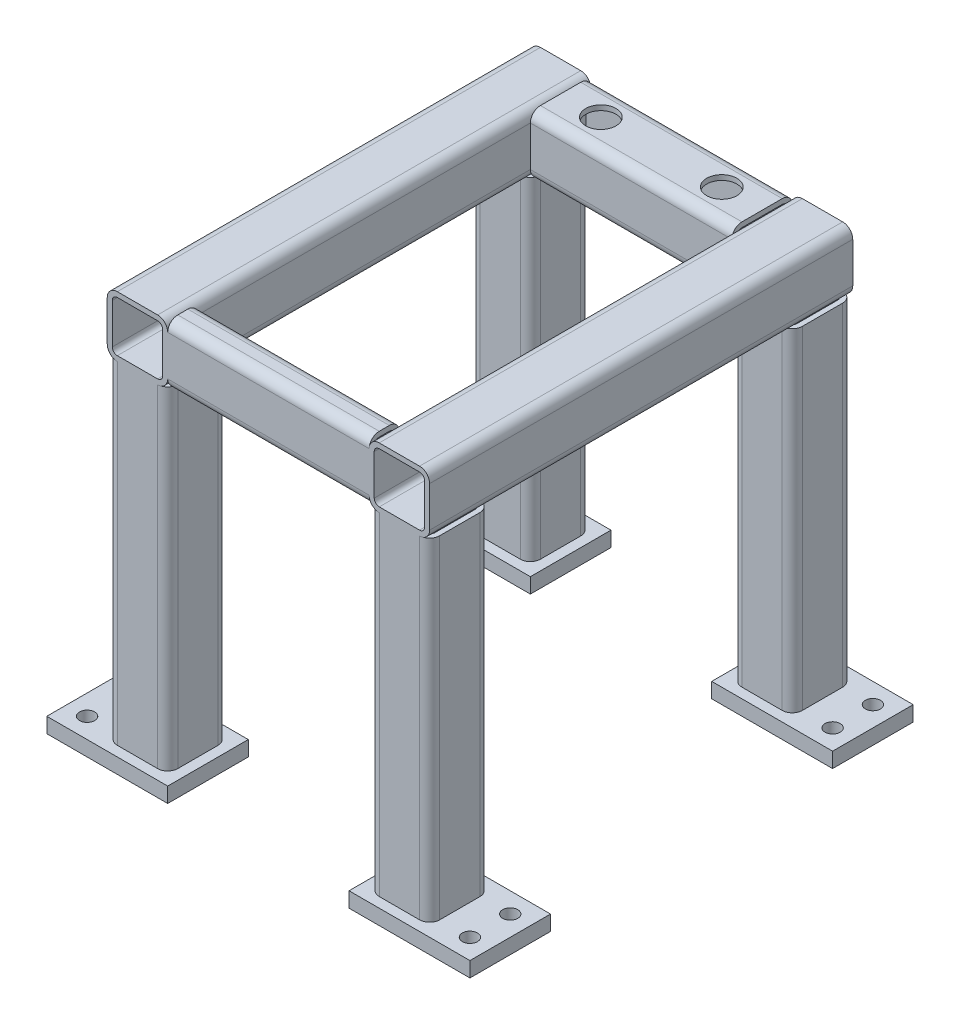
from build123d import *

# Parameters (mm, degrees)
BASE_EXTRUDE_THIN_DEPTH  = 127
BOSS_EXTRUDE_THIN2_DEPTH = 533.4
BOSS_EXTRUDE_THIN3_DEPTH = 127
BOSS_EXTRUDE_THIN4_DEPTH = 438.404
BOSS_EXTRUDE_THIN5_DEPTH = 438.404
SKETCH10_W               = 101.6
SKETCH10_H               = 152.4
SKETCH10_R               = 9.525
BOSS_EXTRUDE7_DEPTH      = 19.05
SKETCH11_W               = 101.6
SKETCH11_H               = 152.4
SKETCH11_R               = 9.525
BOSS_EXTRUDE8_DEPTH      = 19.05
SKETCH12_R               = 19.05
CUT_EXTRUDE1_DEPTH       = 750.219275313


with BuildPart() as part:
    # Sketch4 → Base-Extrude-Thin (new body)
    with BuildSketch(Plane(origin=(0, 0, 0), x_dir=(0, 0, -1), z_dir=(1, 0, 0))):
        with BuildLine():
            Line((-12.7, 0), (-63.5, 0))
            ThreePointArc((-63.5, 0), (-72.480256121, -3.719743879), (-76.2, -12.7))
            Line((-76.2, -12.7), (-76.2, -63.5))
            ThreePointArc((-76.2, -63.5), (-72.480256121, -72.480256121), (-63.5, -76.2))
            Line((-63.5, -76.2), (-12.7, -76.2))
            ThreePointArc((-12.7, -76.2), (-3.719743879, -72.480256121), (0, -63.5))
            Line((0, -63.5), (0, -12.7))
            ThreePointArc((0, -12.7), (-3.719743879, -3.719743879), (-12.7, 0))
        make_face()
        with BuildLine():
            Line((-12.7, -6.35), (-63.5, -6.35))
            ThreePointArc((-63.5, -6.35), (-67.990128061, -8.209871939), (-69.85, -12.7))
            Line((-69.85, -12.7), (-69.85, -63.5))
            ThreePointArc((-69.85, -63.5), (-67.990128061, -67.990128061), (-63.5, -69.85))
            Line((-63.5, -69.85), (-12.7, -69.85))
            ThreePointArc((-12.7, -69.85), (-8.209871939, -67.990128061), (-6.35, -63.5))
            Line((-6.35, -63.5), (-6.35, -12.7))
            ThreePointArc((-6.35, -12.7), (-8.209871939, -8.209871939), (-12.7, -6.35))
        make_face(mode=Mode.SUBTRACT)
    extrude(amount=BASE_EXTRUDE_THIN_DEPTH)

    # Sketch5 → Boss-Extrude-Thin2 (add)
    with BuildSketch(Plane(origin=(0, 0, 0), x_dir=(-1, 0, 0), z_dir=(0, 0, -1))):
        with BuildLine():
            Line((-139.7, 0), (-190.5, 0))
            ThreePointArc((-190.5, 0), (-199.480256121, -3.719743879), (-203.2, -12.7))
            Line((-203.2, -12.7), (-203.2, -63.5))
            ThreePointArc((-203.2, -63.5), (-199.480256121, -72.480256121), (-190.5, -76.2))
            Line((-190.5, -76.2), (-139.7, -76.2))
            ThreePointArc((-139.7, -76.2), (-130.719743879, -72.480256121), (-127, -63.5))
            Line((-127, -63.5), (-127, -12.7))
            ThreePointArc((-127, -12.7), (-130.719743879, -3.719743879), (-139.7, 0))
        make_face()
        with BuildLine():
            Line((-139.7, -6.35), (-190.5, -6.35))
            ThreePointArc((-190.5, -6.35), (-194.990128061, -8.209871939), (-196.85, -12.7))
            Line((-196.85, -12.7), (-196.85, -63.5))
            ThreePointArc((-196.85, -63.5), (-194.990128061, -67.990128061), (-190.5, -69.85))
            Line((-190.5, -69.85), (-139.7, -69.85))
            ThreePointArc((-139.7, -69.85), (-135.209871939, -67.990128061), (-133.35, -63.5))
            Line((-133.35, -63.5), (-133.35, -12.7))
            ThreePointArc((-133.35, -12.7), (-135.209871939, -8.209871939), (-139.7, -6.35))
        make_face(mode=Mode.SUBTRACT)
    extrude(amount=-BOSS_EXTRUDE_THIN2_DEPTH)

    # Sketch6 → Boss-Extrude-Thin3 (add)
    with BuildSketch(Plane.ZY.offset(-127)):
        with BuildLine():
            Line((520.7, 0), (508, 0))
            ThreePointArc((508, 0), (499.019743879, -3.719743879), (495.3, -12.7))
            Line((495.3, -12.7), (495.3, -63.5))
            ThreePointArc((495.3, -63.5), (499.019743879, -72.480256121), (508, -76.2))
            Line((508, -76.2), (520.7, -76.2))
            ThreePointArc((520.7, -76.2), (529.680256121, -72.480256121), (533.4, -63.5))
            Line((533.4, -63.5), (533.4, -12.7))
            ThreePointArc((533.4, -12.7), (529.680256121, -3.719743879), (520.7, 0))
        make_face()
        with BuildLine():
            Line((520.7, -6.35), (508, -6.35))
            ThreePointArc((508, -6.35), (503.509871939, -8.209871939), (501.65, -12.7))
            Line((501.65, -12.7), (501.65, -63.5))
            ThreePointArc((501.65, -63.5), (503.509871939, -67.990128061), (508, -69.85))
            Line((508, -69.85), (520.7, -69.85))
            ThreePointArc((520.7, -69.85), (525.190128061, -67.990128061), (527.05, -63.5))
            Line((527.05, -63.5), (527.05, -12.7))
            ThreePointArc((527.05, -12.7), (525.190128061, -8.209871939), (520.7, -6.35))
        make_face(mode=Mode.SUBTRACT)
    extrude(amount=BOSS_EXTRUDE_THIN3_DEPTH)

    # Sketch7 → Boss-Extrude-Thin4 (add)
    with BuildSketch(Plane(origin=(-555.748263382, -514.35, 156.567901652), x_dir=(1, 0, 0), z_dir=(0, -1, 0))):
        with BuildLine():
            Line((746.248263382, -80.367901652), (695.448263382, -80.367901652))
            ThreePointArc((695.448263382, -80.367901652), (686.468007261, -84.087645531), (682.748263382, -93.067901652))
            Line((682.748263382, -93.067901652), (682.748263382, -143.867901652))
            ThreePointArc((682.748263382, -143.867901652), (686.468007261, -152.848157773), (695.448263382, -156.567901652))
            Line((695.448263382, -156.567901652), (746.248263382, -156.567901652))
            ThreePointArc((746.248263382, -156.567901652), (755.228519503, -152.848157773), (758.948263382, -143.867901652))
            Line((758.948263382, -143.867901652), (758.948263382, -93.067901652))
            ThreePointArc((758.948263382, -93.067901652), (755.228519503, -84.087645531), (746.248263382, -80.367901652))
        make_face()
        with BuildLine():
            Line((746.248263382, -86.717901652), (695.448263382, -86.717901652))
            ThreePointArc((695.448263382, -86.717901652), (690.958135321, -88.577773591), (689.098263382, -93.067901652))
            Line((689.098263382, -93.067901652), (689.098263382, -143.867901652))
            ThreePointArc((689.098263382, -143.867901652), (690.958135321, -148.358029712), (695.448263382, -150.217901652))
            Line((695.448263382, -150.217901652), (746.248263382, -150.217901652))
            ThreePointArc((746.248263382, -150.217901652), (750.738391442, -148.358029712), (752.598263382, -143.867901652))
            Line((752.598263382, -143.867901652), (752.598263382, -93.067901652))
            ThreePointArc((752.598263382, -93.067901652), (750.738391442, -88.577773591), (746.248263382, -86.717901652))
        make_face(mode=Mode.SUBTRACT)
    extrude(amount=-BOSS_EXTRUDE_THIN4_DEPTH)

    # Sketch9 → Boss-Extrude-Thin5 (add)
    with BuildSketch(Plane(origin=(-555.748263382, -514.35, 156.567901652), x_dir=(1, 0, 0), z_dir=(0, -1, 0))):
        with BuildLine():
            Line((746.248263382, 376.832098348), (695.448263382, 376.832098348))
            ThreePointArc((695.448263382, 376.832098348), (686.468007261, 373.112354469), (682.748263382, 364.132098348))
            Line((682.748263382, 364.132098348), (682.748263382, 313.332098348))
            ThreePointArc((682.748263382, 313.332098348), (686.468007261, 304.351842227), (695.448263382, 300.632098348))
            Line((695.448263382, 300.632098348), (746.248263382, 300.632098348))
            ThreePointArc((746.248263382, 300.632098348), (755.228519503, 304.351842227), (758.948263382, 313.332098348))
            Line((758.948263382, 313.332098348), (758.948263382, 364.132098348))
            ThreePointArc((758.948263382, 364.132098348), (755.228519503, 373.112354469), (746.248263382, 376.832098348))
        make_face()
        with BuildLine():
            Line((746.248263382, 370.482098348), (695.448263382, 370.482098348))
            ThreePointArc((695.448263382, 370.482098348), (690.958135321, 368.622226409), (689.098263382, 364.132098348))
            Line((689.098263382, 364.132098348), (689.098263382, 313.332098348))
            ThreePointArc((689.098263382, 313.332098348), (690.958135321, 308.841970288), (695.448263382, 306.982098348))
            Line((695.448263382, 306.982098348), (746.248263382, 306.982098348))
            ThreePointArc((746.248263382, 306.982098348), (750.738391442, 308.841970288), (752.598263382, 313.332098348))
            Line((752.598263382, 313.332098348), (752.598263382, 364.132098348))
            ThreePointArc((752.598263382, 364.132098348), (750.738391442, 368.622226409), (746.248263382, 370.482098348))
        make_face(mode=Mode.SUBTRACT)
    extrude(amount=-BOSS_EXTRUDE_THIN5_DEPTH)

    # Sketch10 → Boss-Extrude7 (add)
    with BuildSketch(Plane(origin=(-258.35643124, -514.35, 160.021358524), x_dir=(0, 0, -1), z_dir=(0, -1, 0))):
        with Locations((121.921358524, 448.85643124)):
            Rectangle(SKETCH10_W, SKETCH10_H)
        with Locations(Location((147.321358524, 499.65643124, 0), (0, 0, 90))):
            Circle(SKETCH10_R, mode=Mode.SUBTRACT)
        with Locations(Location((96.521358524, 499.65643124, 0), (0, 0, 90))):
            Circle(SKETCH10_R, mode=Mode.SUBTRACT)
    extrude(amount=-BOSS_EXTRUDE7_DEPTH)

    # Sketch11 → Boss-Extrude8 (add)
    with BuildSketch(Plane(origin=(-249.913169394, -514.35, 836.645697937), x_dir=(0, 0, -1), z_dir=(0, -1, 0))):
        with Locations((341.345697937, 440.413169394)):
            Rectangle(SKETCH11_W, SKETCH11_H)
        with Locations((366.745697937, 491.213169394)):
            Circle(SKETCH11_R, mode=Mode.SUBTRACT)
        with Locations((315.945697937, 491.213169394)):
            Circle(SKETCH11_R, mode=Mode.SUBTRACT)
    extrude(amount=-BOSS_EXTRUDE8_DEPTH)

    # Boss-Mirror1: part across face


with BuildPart() as part_1:
    add(part.part)
    add(part.part.mirror(Plane(origin=(0, -38.1, 38.1), x_dir=(0, 0, 1), z_dir=(-1, 0, 0))))

    # Sketch12 → Cut-Extrude1 (cut, through all)
    with BuildSketch(Plane.XZ.offset(76.2)):
        with Locations(Location((-76.2, 38.1, 0), (0, 0, 270))):
            Circle(SKETCH12_R)
        with Locations(Location((76.2, 38.1, 0), (0, 0, 270))):
            Circle(SKETCH12_R)
    extrude(amount=-CUT_EXTRUDE1_DEPTH, mode=Mode.SUBTRACT)


solid = part_1.part
